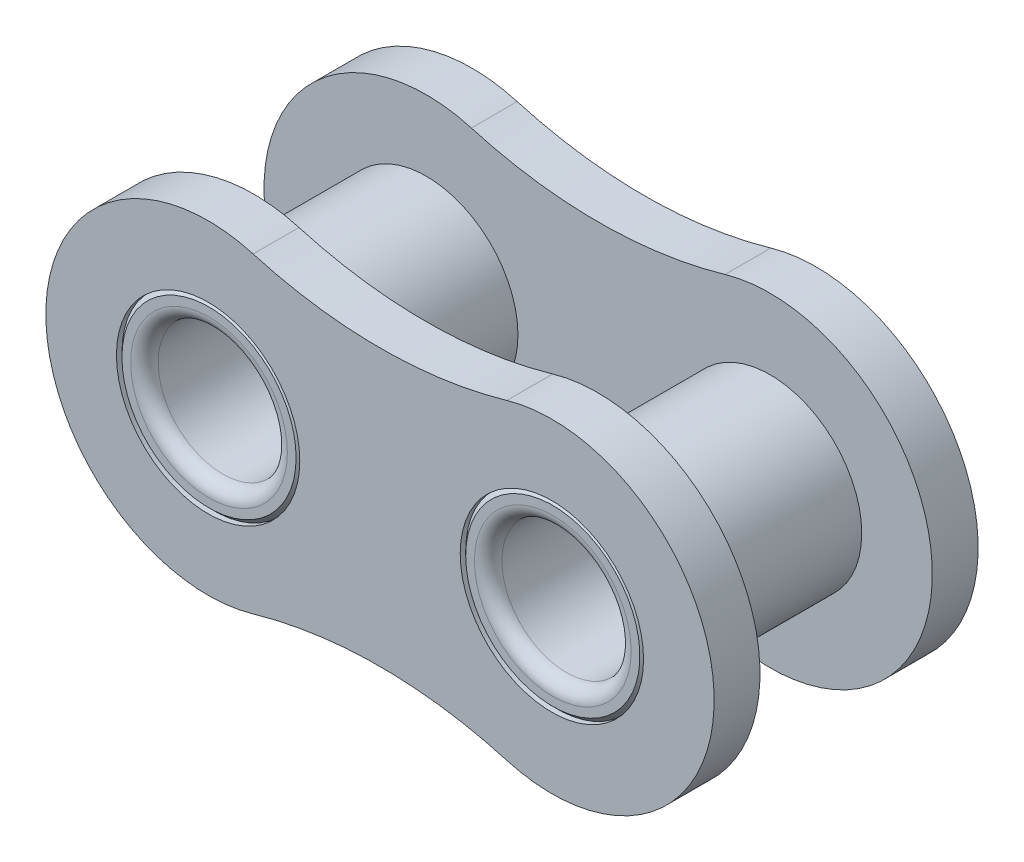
ISO-10303-21;
HEADER;
FILE_DESCRIPTION(('STEP AP214'),'2;1');
FILE_NAME('part.step','',(''),(''),'','','');
FILE_SCHEMA(('AUTOMOTIVE_DESIGN { 1 0 10303 214 1 1 1 1 }'));
ENDSEC;
DATA;
#1=APPLICATION_CONTEXT('core data for automotive mechanical design processes');
#2=APPLICATION_PROTOCOL_DEFINITION('international standard','automotive_design',2000,#1);
#3=PRODUCT_CONTEXT('',#1,'mechanical');
#4=PRODUCT('Part','Part','',(#3));
#5=PRODUCT_RELATED_PRODUCT_CATEGORY('part','',(#4));
#6=PRODUCT_DEFINITION_FORMATION('','',#4);
#7=PRODUCT_DEFINITION_CONTEXT('part definition',#1,'design');
#8=PRODUCT_DEFINITION('design','',#6,#7);
#9=PRODUCT_DEFINITION_SHAPE('','',#8);
#10=(LENGTH_UNIT() NAMED_UNIT(*) SI_UNIT(.MILLI.,.METRE.));
#11=(NAMED_UNIT(*) PLANE_ANGLE_UNIT() SI_UNIT($,.RADIAN.));
#12=(NAMED_UNIT(*) SI_UNIT($,.STERADIAN.) SOLID_ANGLE_UNIT());
#13=UNCERTAINTY_MEASURE_WITH_UNIT(LENGTH_MEASURE(1.E-05),#10,'distance_accuracy_value','');
#14=(GEOMETRIC_REPRESENTATION_CONTEXT(3) GLOBAL_UNCERTAINTY_ASSIGNED_CONTEXT((#13)) GLOBAL_UNIT_ASSIGNED_CONTEXT((#10,
#11,#12)) REPRESENTATION_CONTEXT('',''));
#15=CARTESIAN_POINT('',(0.,0.,0.));
#16=DIRECTION('',(0.,0.,1.));
#17=DIRECTION('',(1.,0.,0.));
#18=AXIS2_PLACEMENT_3D('',#15,#16,#17);
#19=CARTESIAN_POINT('',(4.76249999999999,0.,-3.6322));
#20=DIRECTION('',(0.,0.,-1.));
#21=DIRECTION('',(-1.,0.,0.));
#22=AXIS2_PLACEMENT_3D('',#19,#20,#21);
#23=PLANE('',#22);
#24=CARTESIAN_POINT('',(4.76249999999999,0.,-3.6322));
#25=DIRECTION('',(0.,0.,-1.));
#26=DIRECTION('',(-1.,0.,0.));
#27=AXIS2_PLACEMENT_3D('',#24,#25,#26);
#28=CIRCLE('',#27,2.1717);
#29=CARTESIAN_POINT('',(2.59079999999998,0.,-3.6322));
#30=VERTEX_POINT('',#29);
#31=EDGE_CURVE('E45',#30,#30,#28,.F.);
#32=ORIENTED_EDGE('',*,*,#31,.T.);
#33=EDGE_LOOP('',(#32));
#34=FACE_BOUND('',#33,.T.);
#35=CARTESIAN_POINT('',(4.76249999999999,0.,-3.6322));
#36=DIRECTION('',(0.,0.,-1.));
#37=DIRECTION('',(-1.,0.,0.));
#38=AXIS2_PLACEMENT_3D('',#35,#36,#37);
#39=CIRCLE('',#38,2.413);
#40=CARTESIAN_POINT('',(2.34949999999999,0.,-3.6322));
#41=VERTEX_POINT('',#40);
#42=EDGE_CURVE('E201',#41,#41,#39,.T.);
#43=ORIENTED_EDGE('',*,*,#42,.T.);
#44=EDGE_LOOP('',(#43));
#45=FACE_BOUND('',#44,.T.);
#46=ADVANCED_FACE('F36',(#34,#45),#23,.T.);
#47=CARTESIAN_POINT('',(4.76249999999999,0.,3.6322));
#48=DIRECTION('',(0.,0.,-1.));
#49=DIRECTION('',(-1.,0.,0.));
#50=AXIS2_PLACEMENT_3D('',#47,#48,#49);
#51=PLANE('',#50);
#52=CARTESIAN_POINT('',(4.76249999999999,0.,3.6322));
#53=DIRECTION('',(0.,0.,-1.));
#54=DIRECTION('',(-1.,0.,0.));
#55=AXIS2_PLACEMENT_3D('',#52,#53,#54);
#56=CIRCLE('',#55,2.1717);
#57=CARTESIAN_POINT('',(2.59079999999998,0.,3.6322));
#58=VERTEX_POINT('',#57);
#59=EDGE_CURVE('E204',#58,#58,#56,.T.);
#60=ORIENTED_EDGE('',*,*,#59,.T.);
#61=EDGE_LOOP('',(#60));
#62=FACE_BOUND('',#61,.T.);
#63=CARTESIAN_POINT('',(4.76249999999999,0.,3.6322));
#64=DIRECTION('',(0.,0.,-1.));
#65=DIRECTION('',(-1.,0.,0.));
#66=AXIS2_PLACEMENT_3D('',#63,#64,#65);
#67=CIRCLE('',#66,2.413);
#68=CARTESIAN_POINT('',(2.34949999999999,0.,3.6322));
#69=VERTEX_POINT('',#68);
#70=EDGE_CURVE('E198',#69,#69,#67,.F.);
#71=ORIENTED_EDGE('',*,*,#70,.T.);
#72=EDGE_LOOP('',(#71));
#73=FACE_BOUND('',#72,.T.);
#74=ADVANCED_FACE('F226',(#62,#73),#51,.F.);
#75=CARTESIAN_POINT('',(4.76249999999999,0.,-3.6322));
#76=DIRECTION('',(0.,0.,1.));
#77=DIRECTION('',(1.,0.,0.));
#78=AXIS2_PLACEMENT_3D('',#75,#76,#77);
#79=CYLINDRICAL_SURFACE('',#78,1.7907);
#80=CARTESIAN_POINT('',(4.76249999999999,0.,3.2512));
#81=DIRECTION('',(0.,0.,-1.));
#82=DIRECTION('',(-1.,0.,0.));
#83=AXIS2_PLACEMENT_3D('',#80,#81,#82);
#84=CIRCLE('',#83,1.7907);
#85=CARTESIAN_POINT('',(2.97179999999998,0.,3.2512));
#86=VERTEX_POINT('',#85);
#87=EDGE_CURVE('E210',#86,#86,#84,.F.);
#88=ORIENTED_EDGE('',*,*,#87,.T.);
#89=EDGE_LOOP('',(#88));
#90=FACE_BOUND('',#89,.T.);
#91=CARTESIAN_POINT('',(4.76249999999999,0.,-3.2512));
#92=DIRECTION('',(0.,0.,-1.));
#93=DIRECTION('',(-1.,0.,0.));
#94=AXIS2_PLACEMENT_3D('',#91,#92,#93);
#95=CIRCLE('',#94,1.7907);
#96=CARTESIAN_POINT('',(2.97179999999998,0.,-3.2512));
#97=VERTEX_POINT('',#96);
#98=EDGE_CURVE('E207',#97,#97,#95,.T.);
#99=ORIENTED_EDGE('',*,*,#98,.T.);
#100=EDGE_LOOP('',(#99));
#101=FACE_BOUND('',#100,.T.);
#102=ADVANCED_FACE('F223',(#90,#101),#79,.F.);
#103=CARTESIAN_POINT('',(4.76249999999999,0.,3.5052));
#104=DIRECTION('',(0.,0.,-1.));
#105=DIRECTION('',(-1.,0.,0.));
#106=AXIS2_PLACEMENT_3D('',#103,#104,#105);
#107=CONICAL_SURFACE('',#106,2.54,0.785398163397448);
#108=ORIENTED_EDGE('',*,*,#70,.F.);
#109=EDGE_LOOP('',(#108));
#110=FACE_BOUND('',#109,.T.);
#111=CARTESIAN_POINT('',(4.76249999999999,0.,3.5052));
#112=DIRECTION('',(0.,0.,-1.));
#113=DIRECTION('',(-1.,0.,0.));
#114=AXIS2_PLACEMENT_3D('',#111,#112,#113);
#115=CIRCLE('',#114,2.54);
#116=CARTESIAN_POINT('',(2.22249999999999,0.,3.5052));
#117=VERTEX_POINT('',#116);
#118=EDGE_CURVE('E195',#117,#117,#115,.T.);
#119=ORIENTED_EDGE('',*,*,#118,.F.);
#120=EDGE_LOOP('',(#119));
#121=FACE_BOUND('',#120,.T.);
#122=ADVANCED_FACE('F225',(#110,#121),#107,.T.);
#123=CARTESIAN_POINT('',(4.76249999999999,0.,-3.6322));
#124=DIRECTION('',(0.,0.,1.));
#125=DIRECTION('',(1.,0.,0.));
#126=AXIS2_PLACEMENT_3D('',#123,#124,#125);
#127=CONICAL_SURFACE('',#126,2.413,0.785398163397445);
#128=CARTESIAN_POINT('',(4.76249999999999,0.,-3.5052));
#129=DIRECTION('',(0.,0.,-1.));
#130=DIRECTION('',(-1.,0.,0.));
#131=AXIS2_PLACEMENT_3D('',#128,#129,#130);
#132=CIRCLE('',#131,2.54);
#133=CARTESIAN_POINT('',(2.22249999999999,0.,-3.5052));
#134=VERTEX_POINT('',#133);
#135=EDGE_CURVE('E192',#134,#134,#132,.F.);
#136=ORIENTED_EDGE('',*,*,#135,.F.);
#137=EDGE_LOOP('',(#136));
#138=FACE_BOUND('',#137,.T.);
#139=ORIENTED_EDGE('',*,*,#42,.F.);
#140=EDGE_LOOP('',(#139));
#141=FACE_BOUND('',#140,.T.);
#142=ADVANCED_FACE('F233',(#138,#141),#127,.T.);
#143=CARTESIAN_POINT('',(4.76249999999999,0.,3.2512));
#144=DIRECTION('',(0.,0.,-1.));
#145=DIRECTION('',(-1.,0.,0.));
#146=AXIS2_PLACEMENT_3D('',#143,#144,#145);
#147=TOROIDAL_SURFACE('',#146,2.1717,0.381);
#148=ORIENTED_EDGE('',*,*,#87,.F.);
#149=EDGE_LOOP('',(#148));
#150=FACE_BOUND('',#149,.T.);
#151=ORIENTED_EDGE('',*,*,#59,.F.);
#152=EDGE_LOOP('',(#151));
#153=FACE_BOUND('',#152,.T.);
#154=ADVANCED_FACE('F220',(#150,#153),#147,.T.);
#155=CARTESIAN_POINT('',(4.76249999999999,0.,-3.2512));
#156=DIRECTION('',(0.,0.,-1.));
#157=DIRECTION('',(-1.,0.,0.));
#158=AXIS2_PLACEMENT_3D('',#155,#156,#157);
#159=TOROIDAL_SURFACE('',#158,2.1717,0.381);
#160=ORIENTED_EDGE('',*,*,#31,.F.);
#161=EDGE_LOOP('',(#160));
#162=FACE_BOUND('',#161,.T.);
#163=ORIENTED_EDGE('',*,*,#98,.F.);
#164=EDGE_LOOP('',(#163));
#165=FACE_BOUND('',#164,.T.);
#166=ADVANCED_FACE('F38',(#162,#165),#159,.T.);
#167=CARTESIAN_POINT('',(-2.38124999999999,-8.2397761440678,3.6576));
#168=DIRECTION('',(0.,0.,1.));
#169=DIRECTION('',(1.,0.,0.));
#170=AXIS2_PLACEMENT_3D('',#167,#168,#169);
#171=PLANE('',#170);
#172=CARTESIAN_POINT('',(-4.76249999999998,0.,3.6576));
#173=DIRECTION('',(0.,0.,1.));
#174=DIRECTION('',(1.,0.,0.));
#175=AXIS2_PLACEMENT_3D('',#172,#173,#174);
#176=CIRCLE('',#175,2.54);
#177=CARTESIAN_POINT('',(-2.22249999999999,0.,3.6576));
#178=VERTEX_POINT('',#177);
#179=EDGE_CURVE('E162',#178,#178,#176,.T.);
#180=ORIENTED_EDGE('',*,*,#179,.F.);
#181=EDGE_LOOP('',(#180));
#182=FACE_BOUND('',#181,.T.);
#183=CARTESIAN_POINT('',(-4.76249999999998,0.,3.6576));
#184=DIRECTION('',(0.,0.,1.));
#185=DIRECTION('',(1.,0.,0.));
#186=AXIS2_PLACEMENT_3D('',#183,#184,#185);
#187=CIRCLE('',#186,4.4958);
#188=CARTESIAN_POINT('',(-3.51431622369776,4.3190571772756,3.6576));
#189=VERTEX_POINT('',#188);
#190=CARTESIAN_POINT('',(-3.51431622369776,-4.31905717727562,3.6576));
#191=VERTEX_POINT('',#190);
#192=EDGE_CURVE('E80',#189,#191,#187,.T.);
#193=ORIENTED_EDGE('',*,*,#192,.T.);
#194=CARTESIAN_POINT('',(0.,-16.4795522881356,3.6576));
#195=DIRECTION('',(0.,0.,1.));
#196=DIRECTION('',(1.,0.,0.));
#197=AXIS2_PLACEMENT_3D('',#194,#195,#196);
#198=CIRCLE('',#197,12.6581222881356);
#199=CARTESIAN_POINT('',(3.51431622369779,-4.31905717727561,3.6576));
#200=VERTEX_POINT('',#199);
#201=EDGE_CURVE('E167',#200,#191,#198,.T.);
#202=ORIENTED_EDGE('',*,*,#201,.F.);
#203=CARTESIAN_POINT('',(4.76250000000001,0.,3.6576));
#204=DIRECTION('',(0.,0.,1.));
#205=DIRECTION('',(1.,0.,0.));
#206=AXIS2_PLACEMENT_3D('',#203,#204,#205);
#207=CIRCLE('',#206,4.4958);
#208=CARTESIAN_POINT('',(3.51431622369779,4.31905717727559,3.6576));
#209=VERTEX_POINT('',#208);
#210=EDGE_CURVE('E171',#200,#209,#207,.T.);
#211=ORIENTED_EDGE('',*,*,#210,.T.);
#212=CARTESIAN_POINT('',(0.,16.4795522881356,3.6576));
#213=DIRECTION('',(0.,0.,1.));
#214=DIRECTION('',(1.,0.,0.));
#215=AXIS2_PLACEMENT_3D('',#212,#213,#214);
#216=CIRCLE('',#215,12.6581222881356);
#217=EDGE_CURVE('E173',#189,#209,#216,.T.);
#218=ORIENTED_EDGE('',*,*,#217,.F.);
#219=EDGE_LOOP('',(#193,#202,#211,#218));
#220=FACE_BOUND('',#219,.T.);
#221=CARTESIAN_POINT('',(4.76250000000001,0.,3.6576));
#222=DIRECTION('',(0.,0.,1.));
#223=DIRECTION('',(1.,0.,0.));
#224=AXIS2_PLACEMENT_3D('',#221,#222,#223);
#225=CIRCLE('',#224,2.54);
#226=CARTESIAN_POINT('',(7.30250000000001,0.,3.6576));
#227=VERTEX_POINT('',#226);
#228=EDGE_CURVE('E159',#227,#227,#225,.T.);
#229=ORIENTED_EDGE('',*,*,#228,.F.);
#230=EDGE_LOOP('',(#229));
#231=FACE_BOUND('',#230,.T.);
#232=ADVANCED_FACE('F219',(#182,#220,#231),#171,.T.);
#233=CARTESIAN_POINT('',(-2.38124999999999,-8.2397761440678,2.3876));
#234=DIRECTION('',(0.,0.,1.));
#235=DIRECTION('',(1.,0.,0.));
#236=AXIS2_PLACEMENT_3D('',#233,#234,#235);
#237=PLANE('',#236);
#238=CARTESIAN_POINT('',(-4.76249999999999,0.,2.3876));
#239=DIRECTION('',(0.,0.,1.));
#240=DIRECTION('',(1.,0.,0.));
#241=AXIS2_PLACEMENT_3D('',#238,#239,#240);
#242=CIRCLE('',#241,2.54);
#243=CARTESIAN_POINT('',(-2.22249999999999,0.,2.3876));
#244=VERTEX_POINT('',#243);
#245=EDGE_CURVE('E156',#244,#244,#242,.F.);
#246=ORIENTED_EDGE('',*,*,#245,.F.);
#247=EDGE_LOOP('',(#246));
#248=FACE_BOUND('',#247,.T.);
#249=CARTESIAN_POINT('',(-4.76249999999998,0.,2.3876));
#250=DIRECTION('',(0.,0.,1.));
#251=DIRECTION('',(1.,0.,0.));
#252=AXIS2_PLACEMENT_3D('',#249,#250,#251);
#253=CIRCLE('',#252,4.4958);
#254=CARTESIAN_POINT('',(-3.51431622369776,4.3190571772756,2.3876));
#255=VERTEX_POINT('',#254);
#256=CARTESIAN_POINT('',(-3.51431622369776,-4.31905717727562,2.3876));
#257=VERTEX_POINT('',#256);
#258=EDGE_CURVE('E165',#255,#257,#253,.T.);
#259=ORIENTED_EDGE('',*,*,#258,.F.);
#260=CARTESIAN_POINT('',(0.,16.4795522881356,2.3876));
#261=DIRECTION('',(0.,0.,1.));
#262=DIRECTION('',(1.,0.,0.));
#263=AXIS2_PLACEMENT_3D('',#260,#261,#262);
#264=CIRCLE('',#263,12.6581222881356);
#265=CARTESIAN_POINT('',(3.51431622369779,4.31905717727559,2.3876));
#266=VERTEX_POINT('',#265);
#267=EDGE_CURVE('E168',#255,#266,#264,.T.);
#268=ORIENTED_EDGE('',*,*,#267,.T.);
#269=CARTESIAN_POINT('',(4.76250000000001,0.,2.3876));
#270=DIRECTION('',(0.,0.,1.));
#271=DIRECTION('',(1.,0.,0.));
#272=AXIS2_PLACEMENT_3D('',#269,#270,#271);
#273=CIRCLE('',#272,4.4958);
#274=CARTESIAN_POINT('',(3.51431622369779,-4.31905717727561,2.3876));
#275=VERTEX_POINT('',#274);
#276=EDGE_CURVE('E179',#275,#266,#273,.T.);
#277=ORIENTED_EDGE('',*,*,#276,.F.);
#278=CARTESIAN_POINT('',(0.,-16.4795522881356,2.3876));
#279=DIRECTION('',(0.,0.,1.));
#280=DIRECTION('',(1.,0.,0.));
#281=AXIS2_PLACEMENT_3D('',#278,#279,#280);
#282=CIRCLE('',#281,12.6581222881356);
#283=EDGE_CURVE('E176',#275,#257,#282,.T.);
#284=ORIENTED_EDGE('',*,*,#283,.T.);
#285=EDGE_LOOP('',(#259,#268,#277,#284));
#286=FACE_BOUND('',#285,.T.);
#287=CARTESIAN_POINT('',(4.76249999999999,0.,2.3876));
#288=DIRECTION('',(0.,0.,1.));
#289=DIRECTION('',(1.,0.,0.));
#290=AXIS2_PLACEMENT_3D('',#287,#288,#289);
#291=CIRCLE('',#290,2.54);
#292=CARTESIAN_POINT('',(7.30249999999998,0.,2.3876));
#293=VERTEX_POINT('',#292);
#294=EDGE_CURVE('E11',#293,#293,#291,.T.);
#295=ORIENTED_EDGE('',*,*,#294,.T.);
#296=EDGE_LOOP('',(#295));
#297=FACE_BOUND('',#296,.T.);
#298=ADVANCED_FACE('F273',(#248,#286,#297),#237,.F.);
#299=CARTESIAN_POINT('',(-4.76249999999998,0.,3.6576));
#300=DIRECTION('',(0.,0.,-1.));
#301=DIRECTION('',(-1.,0.,0.));
#302=AXIS2_PLACEMENT_3D('',#299,#300,#301);
#303=CYLINDRICAL_SURFACE('',#302,4.4958);
#304=ORIENTED_EDGE('',*,*,#258,.T.);
#305=DIRECTION('',(0.,0.,-1.));
#306=VECTOR('',#305,1.);
#307=CARTESIAN_POINT('',(-3.51431622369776,-4.31905717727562,3.6576));
#308=LINE('',#307,#306);
#309=EDGE_CURVE('E187',#191,#257,#308,.T.);
#310=ORIENTED_EDGE('',*,*,#309,.F.);
#311=ORIENTED_EDGE('',*,*,#192,.F.);
#312=DIRECTION('',(0.,0.,-1.));
#313=VECTOR('',#312,1.);
#314=CARTESIAN_POINT('',(-3.51431622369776,4.3190571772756,3.6576));
#315=LINE('',#314,#313);
#316=EDGE_CURVE('E53',#189,#255,#315,.T.);
#317=ORIENTED_EDGE('',*,*,#316,.T.);
#318=EDGE_LOOP('',(#304,#310,#311,#317));
#319=FACE_BOUND('',#318,.T.);
#320=ADVANCED_FACE('F277',(#319),#303,.T.);
#321=CARTESIAN_POINT('',(0.,-16.4795522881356,3.6576));
#322=DIRECTION('',(0.,0.,-1.));
#323=DIRECTION('',(-1.,0.,0.));
#324=AXIS2_PLACEMENT_3D('',#321,#322,#323);
#325=CYLINDRICAL_SURFACE('',#324,12.6581222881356);
#326=ORIENTED_EDGE('',*,*,#283,.F.);
#327=DIRECTION('',(0.,0.,-1.));
#328=VECTOR('',#327,1.);
#329=CARTESIAN_POINT('',(3.51431622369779,-4.31905717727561,3.6576));
#330=LINE('',#329,#328);
#331=EDGE_CURVE('E185',#200,#275,#330,.T.);
#332=ORIENTED_EDGE('',*,*,#331,.F.);
#333=ORIENTED_EDGE('',*,*,#201,.T.);
#334=ORIENTED_EDGE('',*,*,#309,.T.);
#335=EDGE_LOOP('',(#326,#332,#333,#334));
#336=FACE_BOUND('',#335,.T.);
#337=ADVANCED_FACE('F289',(#336),#325,.F.);
#338=CARTESIAN_POINT('',(4.76250000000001,0.,3.6576));
#339=DIRECTION('',(0.,0.,-1.));
#340=DIRECTION('',(-1.,0.,0.));
#341=AXIS2_PLACEMENT_3D('',#338,#339,#340);
#342=CYLINDRICAL_SURFACE('',#341,4.4958);
#343=ORIENTED_EDGE('',*,*,#276,.T.);
#344=DIRECTION('',(0.,0.,-1.));
#345=VECTOR('',#344,1.);
#346=CARTESIAN_POINT('',(3.51431622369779,4.31905717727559,3.6576));
#347=LINE('',#346,#345);
#348=EDGE_CURVE('E69',#209,#266,#347,.T.);
#349=ORIENTED_EDGE('',*,*,#348,.F.);
#350=ORIENTED_EDGE('',*,*,#210,.F.);
#351=ORIENTED_EDGE('',*,*,#331,.T.);
#352=EDGE_LOOP('',(#343,#349,#350,#351));
#353=FACE_BOUND('',#352,.T.);
#354=ADVANCED_FACE('F286',(#353),#342,.T.);
#355=CARTESIAN_POINT('',(0.,16.4795522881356,3.6576));
#356=DIRECTION('',(0.,0.,-1.));
#357=DIRECTION('',(-1.,0.,0.));
#358=AXIS2_PLACEMENT_3D('',#355,#356,#357);
#359=CYLINDRICAL_SURFACE('',#358,12.6581222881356);
#360=ORIENTED_EDGE('',*,*,#267,.F.);
#361=ORIENTED_EDGE('',*,*,#316,.F.);
#362=ORIENTED_EDGE('',*,*,#217,.T.);
#363=ORIENTED_EDGE('',*,*,#348,.T.);
#364=EDGE_LOOP('',(#360,#361,#362,#363));
#365=FACE_BOUND('',#364,.T.);
#366=ADVANCED_FACE('F283',(#365),#359,.F.);
#367=CARTESIAN_POINT('',(-4.76249999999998,0.,3.6576));
#368=DIRECTION('',(0.,0.,-1.));
#369=DIRECTION('',(-1.,0.,0.));
#370=AXIS2_PLACEMENT_3D('',#367,#368,#369);
#371=CYLINDRICAL_SURFACE('',#370,2.54);
#372=CARTESIAN_POINT('',(-4.76249999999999,0.,3.5052));
#373=DIRECTION('',(0.,0.,-1.));
#374=DIRECTION('',(-1.,0.,0.));
#375=AXIS2_PLACEMENT_3D('',#372,#373,#374);
#376=CIRCLE('',#375,2.54);
#377=CARTESIAN_POINT('',(-7.30249999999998,0.,3.5052));
#378=VERTEX_POINT('',#377);
#379=EDGE_CURVE('E189',#378,#378,#376,.F.);
#380=ORIENTED_EDGE('',*,*,#379,.F.);
#381=EDGE_LOOP('',(#380));
#382=FACE_BOUND('',#381,.T.);
#383=ORIENTED_EDGE('',*,*,#179,.T.);
#384=EDGE_LOOP('',(#383));
#385=FACE_BOUND('',#384,.T.);
#386=ADVANCED_FACE('F268',(#382,#385),#371,.F.);
#387=CARTESIAN_POINT('',(4.76250000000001,0.,3.6576));
#388=DIRECTION('',(0.,0.,-1.));
#389=DIRECTION('',(-1.,0.,0.));
#390=AXIS2_PLACEMENT_3D('',#387,#388,#389);
#391=CYLINDRICAL_SURFACE('',#390,2.54);
#392=ORIENTED_EDGE('',*,*,#118,.T.);
#393=EDGE_LOOP('',(#392));
#394=FACE_BOUND('',#393,.T.);
#395=ORIENTED_EDGE('',*,*,#228,.T.);
#396=EDGE_LOOP('',(#395));
#397=FACE_BOUND('',#396,.T.);
#398=ADVANCED_FACE('F264',(#394,#397),#391,.F.);
#399=CARTESIAN_POINT('',(-4.76249999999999,0.,3.6322));
#400=DIRECTION('',(0.,0.,-1.));
#401=DIRECTION('',(-1.,0.,0.));
#402=AXIS2_PLACEMENT_3D('',#399,#400,#401);
#403=CYLINDRICAL_SURFACE('',#402,2.54);
#404=CARTESIAN_POINT('',(-4.76249999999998,0.,-2.3876));
#405=DIRECTION('',(0.,0.,1.));
#406=DIRECTION('',(1.,0.,0.));
#407=AXIS2_PLACEMENT_3D('',#404,#405,#406);
#408=CIRCLE('',#407,2.54);
#409=CARTESIAN_POINT('',(-2.22249999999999,0.,-2.3876));
#410=VERTEX_POINT('',#409);
#411=EDGE_CURVE('E143',#410,#410,#408,.T.);
#412=ORIENTED_EDGE('',*,*,#411,.T.);
#413=EDGE_LOOP('',(#412));
#414=FACE_BOUND('',#413,.T.);
#415=ORIENTED_EDGE('',*,*,#245,.T.);
#416=EDGE_LOOP('',(#415));
#417=FACE_BOUND('',#416,.T.);
#418=ADVANCED_FACE('F267',(#414,#417),#403,.T.);
#419=CARTESIAN_POINT('',(-2.38124999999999,-8.2397761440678,-2.3876));
#420=DIRECTION('',(0.,0.,1.));
#421=DIRECTION('',(1.,0.,0.));
#422=AXIS2_PLACEMENT_3D('',#419,#420,#421);
#423=PLANE('',#422);
#424=ORIENTED_EDGE('',*,*,#411,.F.);
#425=EDGE_LOOP('',(#424));
#426=FACE_BOUND('',#425,.T.);
#427=CARTESIAN_POINT('',(-4.76249999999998,0.,-2.3876));
#428=DIRECTION('',(0.,0.,1.));
#429=DIRECTION('',(1.,0.,0.));
#430=AXIS2_PLACEMENT_3D('',#427,#428,#429);
#431=CIRCLE('',#430,4.4958);
#432=CARTESIAN_POINT('',(-3.51431622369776,4.3190571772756,-2.3876));
#433=VERTEX_POINT('',#432);
#434=CARTESIAN_POINT('',(-3.51431622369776,-4.31905717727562,-2.3876));
#435=VERTEX_POINT('',#434);
#436=EDGE_CURVE('E110',#433,#435,#431,.T.);
#437=ORIENTED_EDGE('',*,*,#436,.T.);
#438=CARTESIAN_POINT('',(0.,-16.4795522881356,-2.3876));
#439=DIRECTION('',(0.,0.,1.));
#440=DIRECTION('',(1.,0.,0.));
#441=AXIS2_PLACEMENT_3D('',#438,#439,#440);
#442=CIRCLE('',#441,12.6581222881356);
#443=CARTESIAN_POINT('',(3.51431622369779,-4.31905717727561,-2.3876));
#444=VERTEX_POINT('',#443);
#445=EDGE_CURVE('E115',#444,#435,#442,.T.);
#446=ORIENTED_EDGE('',*,*,#445,.F.);
#447=CARTESIAN_POINT('',(4.76250000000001,0.,-2.3876));
#448=DIRECTION('',(0.,0.,1.));
#449=DIRECTION('',(1.,0.,0.));
#450=AXIS2_PLACEMENT_3D('',#447,#448,#449);
#451=CIRCLE('',#450,4.4958);
#452=CARTESIAN_POINT('',(3.51431622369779,4.31905717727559,-2.3876));
#453=VERTEX_POINT('',#452);
#454=EDGE_CURVE('E134',#444,#453,#451,.T.);
#455=ORIENTED_EDGE('',*,*,#454,.T.);
#456=CARTESIAN_POINT('',(0.,16.4795522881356,-2.3876));
#457=DIRECTION('',(0.,0.,1.));
#458=DIRECTION('',(1.,0.,0.));
#459=AXIS2_PLACEMENT_3D('',#456,#457,#458);
#460=CIRCLE('',#459,12.6581222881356);
#461=EDGE_CURVE('E117',#433,#453,#460,.T.);
#462=ORIENTED_EDGE('',*,*,#461,.F.);
#463=EDGE_LOOP('',(#437,#446,#455,#462));
#464=FACE_BOUND('',#463,.T.);
#465=CARTESIAN_POINT('',(4.76250000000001,0.,-2.3876));
#466=DIRECTION('',(0.,0.,1.));
#467=DIRECTION('',(1.,0.,0.));
#468=AXIS2_PLACEMENT_3D('',#465,#466,#467);
#469=CIRCLE('',#468,2.54);
#470=CARTESIAN_POINT('',(7.30250000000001,0.,-2.3876));
#471=VERTEX_POINT('',#470);
#472=EDGE_CURVE('E590',#471,#471,#469,.T.);
#473=ORIENTED_EDGE('',*,*,#472,.F.);
#474=EDGE_LOOP('',(#473));
#475=FACE_BOUND('',#474,.T.);
#476=ADVANCED_FACE('F112',(#426,#464,#475),#423,.T.);
#477=CARTESIAN_POINT('',(-2.38124999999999,-8.2397761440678,-3.6576));
#478=DIRECTION('',(0.,0.,1.));
#479=DIRECTION('',(1.,0.,0.));
#480=AXIS2_PLACEMENT_3D('',#477,#478,#479);
#481=PLANE('',#480);
#482=CARTESIAN_POINT('',(-4.76249999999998,0.,-3.6576));
#483=DIRECTION('',(0.,0.,1.));
#484=DIRECTION('',(1.,0.,0.));
#485=AXIS2_PLACEMENT_3D('',#482,#483,#484);
#486=CIRCLE('',#485,2.54);
#487=CARTESIAN_POINT('',(-2.22249999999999,0.,-3.6576));
#488=VERTEX_POINT('',#487);
#489=EDGE_CURVE('E593',#488,#488,#486,.T.);
#490=ORIENTED_EDGE('',*,*,#489,.T.);
#491=EDGE_LOOP('',(#490));
#492=FACE_BOUND('',#491,.T.);
#493=CARTESIAN_POINT('',(-4.76249999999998,0.,-3.6576));
#494=DIRECTION('',(0.,0.,1.));
#495=DIRECTION('',(1.,0.,0.));
#496=AXIS2_PLACEMENT_3D('',#493,#494,#495);
#497=CIRCLE('',#496,4.4958);
#498=CARTESIAN_POINT('',(-3.51431622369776,4.3190571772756,-3.6576));
#499=VERTEX_POINT('',#498);
#500=CARTESIAN_POINT('',(-3.51431622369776,-4.31905717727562,-3.6576));
#501=VERTEX_POINT('',#500);
#502=EDGE_CURVE('E125',#499,#501,#497,.T.);
#503=ORIENTED_EDGE('',*,*,#502,.F.);
#504=CARTESIAN_POINT('',(0.,16.4795522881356,-3.6576));
#505=DIRECTION('',(0.,0.,1.));
#506=DIRECTION('',(1.,0.,0.));
#507=AXIS2_PLACEMENT_3D('',#504,#505,#506);
#508=CIRCLE('',#507,12.6581222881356);
#509=CARTESIAN_POINT('',(3.51431622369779,4.31905717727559,-3.6576));
#510=VERTEX_POINT('',#509);
#511=EDGE_CURVE('E119',#499,#510,#508,.T.);
#512=ORIENTED_EDGE('',*,*,#511,.T.);
#513=CARTESIAN_POINT('',(4.76250000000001,0.,-3.6576));
#514=DIRECTION('',(0.,0.,1.));
#515=DIRECTION('',(1.,0.,0.));
#516=AXIS2_PLACEMENT_3D('',#513,#514,#515);
#517=CIRCLE('',#516,4.4958);
#518=CARTESIAN_POINT('',(3.51431622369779,-4.31905717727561,-3.6576));
#519=VERTEX_POINT('',#518);
#520=EDGE_CURVE('E145',#519,#510,#517,.T.);
#521=ORIENTED_EDGE('',*,*,#520,.F.);
#522=CARTESIAN_POINT('',(0.,-16.4795522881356,-3.6576));
#523=DIRECTION('',(0.,0.,1.));
#524=DIRECTION('',(1.,0.,0.));
#525=AXIS2_PLACEMENT_3D('',#522,#523,#524);
#526=CIRCLE('',#525,12.6581222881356);
#527=EDGE_CURVE('E142',#519,#501,#526,.T.);
#528=ORIENTED_EDGE('',*,*,#527,.T.);
#529=EDGE_LOOP('',(#503,#512,#521,#528));
#530=FACE_BOUND('',#529,.T.);
#531=CARTESIAN_POINT('',(4.76250000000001,0.,-3.6576));
#532=DIRECTION('',(0.,0.,1.));
#533=DIRECTION('',(1.,0.,0.));
#534=AXIS2_PLACEMENT_3D('',#531,#532,#533);
#535=CIRCLE('',#534,2.54);
#536=CARTESIAN_POINT('',(7.30250000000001,0.,-3.6576));
#537=VERTEX_POINT('',#536);
#538=EDGE_CURVE('E589',#537,#537,#535,.T.);
#539=ORIENTED_EDGE('',*,*,#538,.T.);
#540=EDGE_LOOP('',(#539));
#541=FACE_BOUND('',#540,.T.);
#542=ADVANCED_FACE('F331',(#492,#530,#541),#481,.F.);
#543=CARTESIAN_POINT('',(-4.76249999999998,0.,-2.3876));
#544=DIRECTION('',(0.,0.,-1.));
#545=DIRECTION('',(-1.,0.,0.));
#546=AXIS2_PLACEMENT_3D('',#543,#544,#545);
#547=CYLINDRICAL_SURFACE('',#546,4.4958);
#548=ORIENTED_EDGE('',*,*,#502,.T.);
#549=DIRECTION('',(0.,0.,-1.));
#550=VECTOR('',#549,1.);
#551=CARTESIAN_POINT('',(-3.51431622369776,-4.31905717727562,-2.3876));
#552=LINE('',#551,#550);
#553=EDGE_CURVE('E122',#435,#501,#552,.T.);
#554=ORIENTED_EDGE('',*,*,#553,.F.);
#555=ORIENTED_EDGE('',*,*,#436,.F.);
#556=DIRECTION('',(0.,0.,-1.));
#557=VECTOR('',#556,1.);
#558=CARTESIAN_POINT('',(-3.51431622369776,4.3190571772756,-2.3876));
#559=LINE('',#558,#557);
#560=EDGE_CURVE('E140',#433,#499,#559,.T.);
#561=ORIENTED_EDGE('',*,*,#560,.T.);
#562=EDGE_LOOP('',(#548,#554,#555,#561));
#563=FACE_BOUND('',#562,.T.);
#564=ADVANCED_FACE('F123',(#563),#547,.T.);
#565=CARTESIAN_POINT('',(0.,-16.4795522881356,-2.3876));
#566=DIRECTION('',(0.,0.,-1.));
#567=DIRECTION('',(-1.,0.,0.));
#568=AXIS2_PLACEMENT_3D('',#565,#566,#567);
#569=CYLINDRICAL_SURFACE('',#568,12.6581222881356);
#570=ORIENTED_EDGE('',*,*,#527,.F.);
#571=DIRECTION('',(0.,0.,-1.));
#572=VECTOR('',#571,1.);
#573=CARTESIAN_POINT('',(3.51431622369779,-4.31905717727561,-2.3876));
#574=LINE('',#573,#572);
#575=EDGE_CURVE('E130',#444,#519,#574,.T.);
#576=ORIENTED_EDGE('',*,*,#575,.F.);
#577=ORIENTED_EDGE('',*,*,#445,.T.);
#578=ORIENTED_EDGE('',*,*,#553,.T.);
#579=EDGE_LOOP('',(#570,#576,#577,#578));
#580=FACE_BOUND('',#579,.T.);
#581=ADVANCED_FACE('F132',(#580),#569,.F.);
#582=CARTESIAN_POINT('',(4.76250000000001,0.,-2.3876));
#583=DIRECTION('',(0.,0.,-1.));
#584=DIRECTION('',(-1.,0.,0.));
#585=AXIS2_PLACEMENT_3D('',#582,#583,#584);
#586=CYLINDRICAL_SURFACE('',#585,4.4958);
#587=ORIENTED_EDGE('',*,*,#520,.T.);
#588=DIRECTION('',(0.,0.,-1.));
#589=VECTOR('',#588,1.);
#590=CARTESIAN_POINT('',(3.51431622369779,4.31905717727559,-2.3876));
#591=LINE('',#590,#589);
#592=EDGE_CURVE('E151',#453,#510,#591,.T.);
#593=ORIENTED_EDGE('',*,*,#592,.F.);
#594=ORIENTED_EDGE('',*,*,#454,.F.);
#595=ORIENTED_EDGE('',*,*,#575,.T.);
#596=EDGE_LOOP('',(#587,#593,#594,#595));
#597=FACE_BOUND('',#596,.T.);
#598=ADVANCED_FACE('F349',(#597),#586,.T.);
#599=CARTESIAN_POINT('',(0.,16.4795522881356,-2.3876));
#600=DIRECTION('',(0.,0.,-1.));
#601=DIRECTION('',(-1.,0.,0.));
#602=AXIS2_PLACEMENT_3D('',#599,#600,#601);
#603=CYLINDRICAL_SURFACE('',#602,12.6581222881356);
#604=ORIENTED_EDGE('',*,*,#511,.F.);
#605=ORIENTED_EDGE('',*,*,#560,.F.);
#606=ORIENTED_EDGE('',*,*,#461,.T.);
#607=ORIENTED_EDGE('',*,*,#592,.T.);
#608=EDGE_LOOP('',(#604,#605,#606,#607));
#609=FACE_BOUND('',#608,.T.);
#610=ADVANCED_FACE('F355',(#609),#603,.F.);
#611=CARTESIAN_POINT('',(-4.76249999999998,0.,-2.3876));
#612=DIRECTION('',(0.,0.,-1.));
#613=DIRECTION('',(-1.,0.,0.));
#614=AXIS2_PLACEMENT_3D('',#611,#612,#613);
#615=CYLINDRICAL_SURFACE('',#614,2.54);
#616=CARTESIAN_POINT('',(-4.76249999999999,0.,-3.5052));
#617=DIRECTION('',(0.,0.,1.));
#618=DIRECTION('',(1.,0.,0.));
#619=AXIS2_PLACEMENT_3D('',#616,#617,#618);
#620=CIRCLE('',#619,2.54);
#621=CARTESIAN_POINT('',(-2.22249999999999,0.,-3.5052));
#622=VERTEX_POINT('',#621);
#623=EDGE_CURVE('E129',#622,#622,#620,.F.);
#624=ORIENTED_EDGE('',*,*,#623,.F.);
#625=EDGE_LOOP('',(#624));
#626=FACE_BOUND('',#625,.T.);
#627=ORIENTED_EDGE('',*,*,#489,.F.);
#628=EDGE_LOOP('',(#627));
#629=FACE_BOUND('',#628,.T.);
#630=ADVANCED_FACE('F362',(#626,#629),#615,.F.);
#631=CARTESIAN_POINT('',(4.76250000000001,0.,-2.3876));
#632=DIRECTION('',(0.,0.,-1.));
#633=DIRECTION('',(-1.,0.,0.));
#634=AXIS2_PLACEMENT_3D('',#631,#632,#633);
#635=CYLINDRICAL_SURFACE('',#634,2.54);
#636=ORIENTED_EDGE('',*,*,#135,.T.);
#637=EDGE_LOOP('',(#636));
#638=FACE_BOUND('',#637,.T.);
#639=ORIENTED_EDGE('',*,*,#538,.F.);
#640=EDGE_LOOP('',(#639));
#641=FACE_BOUND('',#640,.T.);
#642=ADVANCED_FACE('F369',(#638,#641),#635,.F.);
#643=CARTESIAN_POINT('',(-4.76249999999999,0.,3.6322));
#644=DIRECTION('',(0.,0.,1.));
#645=DIRECTION('',(1.,0.,0.));
#646=AXIS2_PLACEMENT_3D('',#643,#644,#645);
#647=PLANE('',#646);
#648=CARTESIAN_POINT('',(-4.76249999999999,0.,3.6322));
#649=DIRECTION('',(0.,0.,1.));
#650=DIRECTION('',(1.,0.,0.));
#651=AXIS2_PLACEMENT_3D('',#648,#649,#650);
#652=CIRCLE('',#651,2.1717);
#653=CARTESIAN_POINT('',(-2.59079999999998,0.,3.6322));
#654=VERTEX_POINT('',#653);
#655=EDGE_CURVE('E573',#654,#654,#652,.F.);
#656=ORIENTED_EDGE('',*,*,#655,.T.);
#657=EDGE_LOOP('',(#656));
#658=FACE_BOUND('',#657,.T.);
#659=CARTESIAN_POINT('',(-4.76249999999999,0.,3.6322));
#660=DIRECTION('',(0.,0.,1.));
#661=DIRECTION('',(1.,0.,0.));
#662=AXIS2_PLACEMENT_3D('',#659,#660,#661);
#663=CIRCLE('',#662,2.413);
#664=CARTESIAN_POINT('',(-2.34949999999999,0.,3.6322));
#665=VERTEX_POINT('',#664);
#666=EDGE_CURVE('E584',#665,#665,#663,.T.);
#667=ORIENTED_EDGE('',*,*,#666,.T.);
#668=EDGE_LOOP('',(#667));
#669=FACE_BOUND('',#668,.T.);
#670=ADVANCED_FACE('F376',(#658,#669),#647,.T.);
#671=CARTESIAN_POINT('',(-4.76249999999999,0.,-3.6322));
#672=DIRECTION('',(0.,0.,1.));
#673=DIRECTION('',(1.,0.,0.));
#674=AXIS2_PLACEMENT_3D('',#671,#672,#673);
#675=PLANE('',#674);
#676=CARTESIAN_POINT('',(-4.76249999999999,0.,-3.6322));
#677=DIRECTION('',(0.,0.,1.));
#678=DIRECTION('',(1.,0.,0.));
#679=AXIS2_PLACEMENT_3D('',#676,#677,#678);
#680=CIRCLE('',#679,2.1717);
#681=CARTESIAN_POINT('',(-2.59079999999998,0.,-3.6322));
#682=VERTEX_POINT('',#681);
#683=EDGE_CURVE('E579',#682,#682,#680,.T.);
#684=ORIENTED_EDGE('',*,*,#683,.T.);
#685=EDGE_LOOP('',(#684));
#686=FACE_BOUND('',#685,.T.);
#687=CARTESIAN_POINT('',(-4.76249999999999,0.,-3.6322));
#688=DIRECTION('',(0.,0.,1.));
#689=DIRECTION('',(1.,0.,0.));
#690=AXIS2_PLACEMENT_3D('',#687,#688,#689);
#691=CIRCLE('',#690,2.413);
#692=CARTESIAN_POINT('',(-2.34949999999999,0.,-3.6322));
#693=VERTEX_POINT('',#692);
#694=EDGE_CURVE('E615',#693,#693,#691,.F.);
#695=ORIENTED_EDGE('',*,*,#694,.T.);
#696=EDGE_LOOP('',(#695));
#697=FACE_BOUND('',#696,.T.);
#698=ADVANCED_FACE('F383',(#686,#697),#675,.F.);
#699=CARTESIAN_POINT('',(-4.76249999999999,0.,3.6322));
#700=DIRECTION('',(0.,0.,-1.));
#701=DIRECTION('',(-1.,0.,0.));
#702=AXIS2_PLACEMENT_3D('',#699,#700,#701);
#703=CYLINDRICAL_SURFACE('',#702,1.7907);
#704=CARTESIAN_POINT('',(-4.76249999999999,0.,-3.2512));
#705=DIRECTION('',(0.,0.,1.));
#706=DIRECTION('',(1.,0.,0.));
#707=AXIS2_PLACEMENT_3D('',#704,#705,#706);
#708=CIRCLE('',#707,1.7907);
#709=CARTESIAN_POINT('',(-2.97179999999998,0.,-3.2512));
#710=VERTEX_POINT('',#709);
#711=EDGE_CURVE('E578',#710,#710,#708,.F.);
#712=ORIENTED_EDGE('',*,*,#711,.T.);
#713=EDGE_LOOP('',(#712));
#714=FACE_BOUND('',#713,.T.);
#715=CARTESIAN_POINT('',(-4.76249999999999,0.,3.2512));
#716=DIRECTION('',(0.,0.,1.));
#717=DIRECTION('',(1.,0.,0.));
#718=AXIS2_PLACEMENT_3D('',#715,#716,#717);
#719=CIRCLE('',#718,1.7907);
#720=CARTESIAN_POINT('',(-2.97179999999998,0.,3.2512));
#721=VERTEX_POINT('',#720);
#722=EDGE_CURVE('E576',#721,#721,#719,.T.);
#723=ORIENTED_EDGE('',*,*,#722,.T.);
#724=EDGE_LOOP('',(#723));
#725=FACE_BOUND('',#724,.T.);
#726=ADVANCED_FACE('F390',(#714,#725),#703,.F.);
#727=CARTESIAN_POINT('',(-4.76249999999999,0.,-3.5052));
#728=DIRECTION('',(0.,0.,1.));
#729=DIRECTION('',(1.,0.,0.));
#730=AXIS2_PLACEMENT_3D('',#727,#728,#729);
#731=CONICAL_SURFACE('',#730,2.54,0.785398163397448);
#732=ORIENTED_EDGE('',*,*,#694,.F.);
#733=EDGE_LOOP('',(#732));
#734=FACE_BOUND('',#733,.T.);
#735=ORIENTED_EDGE('',*,*,#623,.T.);
#736=EDGE_LOOP('',(#735));
#737=FACE_BOUND('',#736,.T.);
#738=ADVANCED_FACE('F397',(#734,#737),#731,.T.);
#739=CARTESIAN_POINT('',(-4.76249999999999,0.,3.6322));
#740=DIRECTION('',(0.,0.,-1.));
#741=DIRECTION('',(-1.,0.,0.));
#742=AXIS2_PLACEMENT_3D('',#739,#740,#741);
#743=CONICAL_SURFACE('',#742,2.413,0.785398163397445);
#744=ORIENTED_EDGE('',*,*,#379,.T.);
#745=EDGE_LOOP('',(#744));
#746=FACE_BOUND('',#745,.T.);
#747=ORIENTED_EDGE('',*,*,#666,.F.);
#748=EDGE_LOOP('',(#747));
#749=FACE_BOUND('',#748,.T.);
#750=ADVANCED_FACE('F404',(#746,#749),#743,.T.);
#751=CARTESIAN_POINT('',(-4.76249999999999,0.,-3.2512));
#752=DIRECTION('',(0.,0.,1.));
#753=DIRECTION('',(1.,0.,0.));
#754=AXIS2_PLACEMENT_3D('',#751,#752,#753);
#755=TOROIDAL_SURFACE('',#754,2.1717,0.381);
#756=ORIENTED_EDGE('',*,*,#711,.F.);
#757=EDGE_LOOP('',(#756));
#758=FACE_BOUND('',#757,.T.);
#759=ORIENTED_EDGE('',*,*,#683,.F.);
#760=EDGE_LOOP('',(#759));
#761=FACE_BOUND('',#760,.T.);
#762=ADVANCED_FACE('F411',(#758,#761),#755,.T.);
#763=CARTESIAN_POINT('',(-4.76249999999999,0.,3.2512));
#764=DIRECTION('',(0.,0.,1.));
#765=DIRECTION('',(1.,0.,0.));
#766=AXIS2_PLACEMENT_3D('',#763,#764,#765);
#767=TOROIDAL_SURFACE('',#766,2.1717,0.381);
#768=ORIENTED_EDGE('',*,*,#655,.F.);
#769=EDGE_LOOP('',(#768));
#770=FACE_BOUND('',#769,.T.);
#771=ORIENTED_EDGE('',*,*,#722,.F.);
#772=EDGE_LOOP('',(#771));
#773=FACE_BOUND('',#772,.T.);
#774=ADVANCED_FACE('F248',(#770,#773),#767,.T.);
#775=CARTESIAN_POINT('',(4.76249999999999,0.,-3.6322));
#776=DIRECTION('',(0.,0.,1.));
#777=DIRECTION('',(1.,0.,0.));
#778=AXIS2_PLACEMENT_3D('',#775,#776,#777);
#779=CYLINDRICAL_SURFACE('',#778,2.54);
#780=ORIENTED_EDGE('',*,*,#472,.T.);
#781=EDGE_LOOP('',(#780));
#782=FACE_BOUND('',#781,.T.);
#783=ORIENTED_EDGE('',*,*,#294,.F.);
#784=EDGE_LOOP('',(#783));
#785=FACE_BOUND('',#784,.T.);
#786=ADVANCED_FACE('F246',(#782,#785),#779,.T.);
#787=CLOSED_SHELL('',(#46,#74,#102,#122,#142,#154,#166,#232,#298,#320,#337,#354,#366,#386,#398,
#418,#476,#542,#564,#581,#598,#610,#630,#642,#670,#698,#726,#738,#750,#762,#774,#786));
#788=MANIFOLD_SOLID_BREP('B2',#787);
#789=ADVANCED_BREP_SHAPE_REPRESENTATION('',(#18,#788),#14);
#790=SHAPE_DEFINITION_REPRESENTATION(#9,#789);
ENDSEC;
END-ISO-10303-21;
